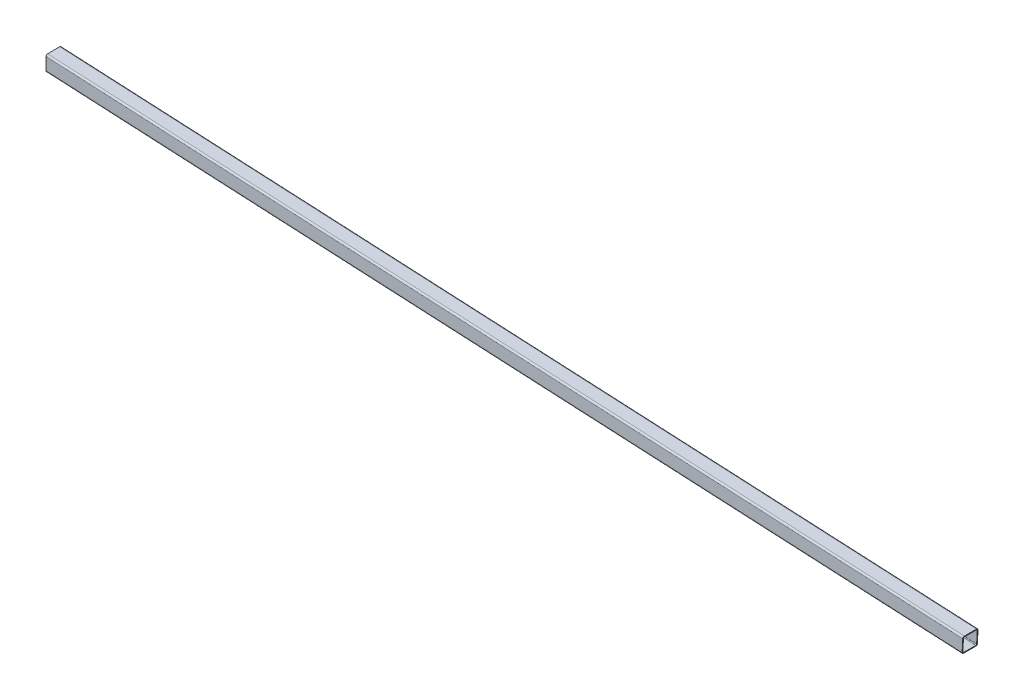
ISO-10303-21;
HEADER;
FILE_DESCRIPTION(('STEP AP214'),'2;1');
FILE_NAME('part.step','',(''),(''),'','','');
FILE_SCHEMA(('AUTOMOTIVE_DESIGN { 1 0 10303 214 1 1 1 1 }'));
ENDSEC;
DATA;
#1=APPLICATION_CONTEXT('core data for automotive mechanical design processes');
#2=APPLICATION_PROTOCOL_DEFINITION('international standard','automotive_design',2000,#1);
#3=PRODUCT_CONTEXT('',#1,'mechanical');
#4=PRODUCT('Part','Part','',(#3));
#5=PRODUCT_RELATED_PRODUCT_CATEGORY('part','',(#4));
#6=PRODUCT_DEFINITION_FORMATION('','',#4);
#7=PRODUCT_DEFINITION_CONTEXT('part definition',#1,'design');
#8=PRODUCT_DEFINITION('design','',#6,#7);
#9=PRODUCT_DEFINITION_SHAPE('','',#8);
#10=(LENGTH_UNIT() NAMED_UNIT(*) SI_UNIT(.MILLI.,.METRE.));
#11=(NAMED_UNIT(*) PLANE_ANGLE_UNIT() SI_UNIT($,.RADIAN.));
#12=(NAMED_UNIT(*) SI_UNIT($,.STERADIAN.) SOLID_ANGLE_UNIT());
#13=UNCERTAINTY_MEASURE_WITH_UNIT(LENGTH_MEASURE(1.E-05),#10,'distance_accuracy_value','');
#14=(GEOMETRIC_REPRESENTATION_CONTEXT(3) GLOBAL_UNCERTAINTY_ASSIGNED_CONTEXT((#13)) GLOBAL_UNIT_ASSIGNED_CONTEXT((#10,
#11,#12)) REPRESENTATION_CONTEXT('',''));
#15=CARTESIAN_POINT('',(0.,0.,0.));
#16=DIRECTION('',(0.,0.,1.));
#17=DIRECTION('',(1.,0.,0.));
#18=AXIS2_PLACEMENT_3D('',#15,#16,#17);
#19=CARTESIAN_POINT('',(6158.33279235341,62.0562979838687,-40.));
#20=DIRECTION('',(0.0500056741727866,0.998748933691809,0.));
#21=DIRECTION('',(-0.998748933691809,0.0500056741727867,0.));
#22=AXIS2_PLACEMENT_3D('',#19,#20,#21);
#23=PLANE('',#22);
#24=DIRECTION('',(-0.998748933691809,0.0500056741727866,0.));
#25=VECTOR('',#24,1.);
#26=CARTESIAN_POINT('',(6158.33279235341,62.0562979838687,40.));
#27=LINE('',#26,#25);
#28=CARTESIAN_POINT('',(6158.33279235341,62.0562979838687,40.));
#29=VERTEX_POINT('',#28);
#30=CARTESIAN_POINT('',(169.999999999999,361.882018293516,40.));
#31=VERTEX_POINT('',#30);
#32=EDGE_CURVE('E150',#29,#31,#27,.T.);
#33=ORIENTED_EDGE('',*,*,#32,.F.);
#34=DIRECTION('',(0.,0.,-1.));
#35=VECTOR('',#34,1.);
#36=CARTESIAN_POINT('',(6158.33279235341,62.0562979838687,-40.));
#37=LINE('',#36,#35);
#38=CARTESIAN_POINT('',(6158.33279235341,62.0562979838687,-40.));
#39=VERTEX_POINT('',#38);
#40=EDGE_CURVE('E53',#29,#39,#37,.T.);
#41=ORIENTED_EDGE('',*,*,#40,.T.);
#42=DIRECTION('',(-0.998748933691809,0.0500056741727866,0.));
#43=VECTOR('',#42,1.);
#44=CARTESIAN_POINT('',(6158.33279235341,62.0562979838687,-40.));
#45=LINE('',#44,#43);
#46=CARTESIAN_POINT('',(169.999999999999,361.882018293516,-40.));
#47=VERTEX_POINT('',#46);
#48=EDGE_CURVE('E38',#39,#47,#45,.T.);
#49=ORIENTED_EDGE('',*,*,#48,.T.);
#50=DIRECTION('',(0.,0.,1.));
#51=VECTOR('',#50,1.);
#52=CARTESIAN_POINT('',(169.999999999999,361.882018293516,-39.9999999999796));
#53=LINE('',#52,#51);
#54=EDGE_CURVE('E193',#47,#31,#53,.T.);
#55=ORIENTED_EDGE('',*,*,#54,.T.);
#56=EDGE_LOOP('',(#33,#41,#49,#55));
#57=FACE_BOUND('',#56,.T.);
#58=ADVANCED_FACE('F34',(#57),#23,.T.);
#59=CARTESIAN_POINT('',(6158.58282072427,67.0500426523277,-40.));
#60=DIRECTION('',(-0.998748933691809,0.0500056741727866,0.));
#61=DIRECTION('',(-0.0500056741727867,-0.998748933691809,0.));
#62=AXIS2_PLACEMENT_3D('',#59,#60,#61);
#63=CYLINDRICAL_SURFACE('',#62,4.99999999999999);
#64=ORIENTED_EDGE('',*,*,#48,.F.);
#65=CARTESIAN_POINT('',(6158.58282072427,67.0500426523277,-40.));
#66=DIRECTION('',(0.998748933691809,-0.0500056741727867,0.));
#67=DIRECTION('',(0.0500056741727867,0.998748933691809,0.));
#68=AXIS2_PLACEMENT_3D('',#65,#66,#67);
#69=CIRCLE('',#68,4.99999999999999);
#70=CARTESIAN_POINT('',(6158.58282072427,67.0500426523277,-45.));
#71=VERTEX_POINT('',#70);
#72=EDGE_CURVE('E186',#39,#71,#69,.T.);
#73=ORIENTED_EDGE('',*,*,#72,.T.);
#74=DIRECTION('',(-0.998748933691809,0.0500056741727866,0.));
#75=VECTOR('',#74,1.);
#76=CARTESIAN_POINT('',(6158.58282072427,67.0500426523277,-45.));
#77=LINE('',#76,#75);
#78=CARTESIAN_POINT('',(169.999999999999,366.888281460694,-45.));
#79=VERTEX_POINT('',#78);
#80=EDGE_CURVE('E184',#71,#79,#77,.T.);
#81=ORIENTED_EDGE('',*,*,#80,.T.);
#82=CARTESIAN_POINT('',(169.999999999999,366.888281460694,-40.));
#83=DIRECTION('',(-1.,0.,0.));
#84=DIRECTION('',(0.,1.,0.));
#85=AXIS2_PLACEMENT_3D('',#82,#83,#84);
#86=ELLIPSE('',#85,5.00626316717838,4.99999999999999);
#87=EDGE_CURVE('E185',#79,#47,#86,.T.);
#88=ORIENTED_EDGE('',*,*,#87,.T.);
#89=EDGE_LOOP('',(#64,#73,#81,#88));
#90=FACE_BOUND('',#89,.T.);
#91=ADVANCED_FACE('F290',(#90),#63,.F.);
#92=CARTESIAN_POINT('',(6158.58282072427,67.0500426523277,-45.));
#93=DIRECTION('',(0.,0.,1.));
#94=DIRECTION('',(0.,-1.,0.));
#95=AXIS2_PLACEMENT_3D('',#92,#93,#94);
#96=PLANE('',#95);
#97=ORIENTED_EDGE('',*,*,#80,.F.);
#98=DIRECTION('',(0.0500056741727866,0.998748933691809,0.));
#99=VECTOR('',#98,1.);
#100=CARTESIAN_POINT('',(6158.58282072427,67.0500426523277,-45.));
#101=LINE('',#100,#99);
#102=CARTESIAN_POINT('',(6162.5832746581,146.949957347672,-45.));
#103=VERTEX_POINT('',#102);
#104=EDGE_CURVE('E183',#71,#103,#101,.T.);
#105=ORIENTED_EDGE('',*,*,#104,.T.);
#106=DIRECTION('',(-0.998748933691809,0.0500056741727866,0.));
#107=VECTOR('',#106,1.);
#108=CARTESIAN_POINT('',(6162.5832746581,146.949957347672,-45.));
#109=LINE('',#108,#107);
#110=CARTESIAN_POINT('',(169.999999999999,446.988492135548,-45.));
#111=VERTEX_POINT('',#110);
#112=EDGE_CURVE('E181',#103,#111,#109,.T.);
#113=ORIENTED_EDGE('',*,*,#112,.T.);
#114=DIRECTION('',(0.,-1.,0.));
#115=VECTOR('',#114,1.);
#116=CARTESIAN_POINT('',(169.999999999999,67.0500426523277,-45.));
#117=LINE('',#116,#115);
#118=EDGE_CURVE('E182',#111,#79,#117,.T.);
#119=ORIENTED_EDGE('',*,*,#118,.T.);
#120=EDGE_LOOP('',(#97,#105,#113,#119));
#121=FACE_BOUND('',#120,.T.);
#122=ADVANCED_FACE('F289',(#121),#96,.T.);
#123=CARTESIAN_POINT('',(6162.5832746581,146.949957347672,-40.));
#124=DIRECTION('',(-0.998748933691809,0.0500056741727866,0.));
#125=DIRECTION('',(-0.0500056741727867,-0.998748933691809,0.));
#126=AXIS2_PLACEMENT_3D('',#123,#124,#125);
#127=CYLINDRICAL_SURFACE('',#126,4.99999999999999);
#128=ORIENTED_EDGE('',*,*,#112,.F.);
#129=CARTESIAN_POINT('',(6162.5832746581,146.949957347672,-40.));
#130=DIRECTION('',(0.998748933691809,-0.0500056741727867,0.));
#131=DIRECTION('',(0.0500056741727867,0.998748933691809,0.));
#132=AXIS2_PLACEMENT_3D('',#129,#130,#131);
#133=CIRCLE('',#132,4.99999999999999);
#134=CARTESIAN_POINT('',(6162.83330302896,151.943702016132,-40.));
#135=VERTEX_POINT('',#134);
#136=EDGE_CURVE('E180',#103,#135,#133,.T.);
#137=ORIENTED_EDGE('',*,*,#136,.T.);
#138=DIRECTION('',(-0.998748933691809,0.0500056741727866,0.));
#139=VECTOR('',#138,1.);
#140=CARTESIAN_POINT('',(6162.83330302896,151.943702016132,-40.));
#141=LINE('',#140,#139);
#142=CARTESIAN_POINT('',(169.999999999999,451.994755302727,-40.));
#143=VERTEX_POINT('',#142);
#144=EDGE_CURVE('E177',#135,#143,#141,.T.);
#145=ORIENTED_EDGE('',*,*,#144,.T.);
#146=CARTESIAN_POINT('',(169.999999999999,446.988492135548,-40.));
#147=DIRECTION('',(-1.,0.,0.));
#148=DIRECTION('',(0.,1.,0.));
#149=AXIS2_PLACEMENT_3D('',#146,#147,#148);
#150=ELLIPSE('',#149,5.00626316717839,4.99999999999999);
#151=EDGE_CURVE('E179',#143,#111,#150,.T.);
#152=ORIENTED_EDGE('',*,*,#151,.T.);
#153=EDGE_LOOP('',(#128,#137,#145,#152));
#154=FACE_BOUND('',#153,.T.);
#155=ADVANCED_FACE('F287',(#154),#127,.F.);
#156=CARTESIAN_POINT('',(6162.83330302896,151.943702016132,40.));
#157=DIRECTION('',(-0.0500056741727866,-0.998748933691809,0.));
#158=DIRECTION('',(0.998748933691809,-0.0500056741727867,0.));
#159=AXIS2_PLACEMENT_3D('',#156,#157,#158);
#160=PLANE('',#159);
#161=ORIENTED_EDGE('',*,*,#144,.F.);
#162=DIRECTION('',(0.,0.,1.));
#163=VECTOR('',#162,1.);
#164=CARTESIAN_POINT('',(6162.83330302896,151.943702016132,40.));
#165=LINE('',#164,#163);
#166=CARTESIAN_POINT('',(6162.83330302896,151.943702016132,40.));
#167=VERTEX_POINT('',#166);
#168=EDGE_CURVE('E176',#135,#167,#165,.T.);
#169=ORIENTED_EDGE('',*,*,#168,.T.);
#170=DIRECTION('',(-0.998748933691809,0.0500056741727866,0.));
#171=VECTOR('',#170,1.);
#172=CARTESIAN_POINT('',(6162.83330302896,151.943702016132,40.));
#173=LINE('',#172,#171);
#174=CARTESIAN_POINT('',(170.,451.994755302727,40.));
#175=VERTEX_POINT('',#174);
#176=EDGE_CURVE('E173',#167,#175,#173,.T.);
#177=ORIENTED_EDGE('',*,*,#176,.T.);
#178=DIRECTION('',(0.,0.,-1.));
#179=VECTOR('',#178,1.);
#180=CARTESIAN_POINT('',(170.,451.994755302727,40.0000000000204));
#181=LINE('',#180,#179);
#182=EDGE_CURVE('E175',#175,#143,#181,.T.);
#183=ORIENTED_EDGE('',*,*,#182,.T.);
#184=EDGE_LOOP('',(#161,#169,#177,#183));
#185=FACE_BOUND('',#184,.T.);
#186=ADVANCED_FACE('F284',(#185),#160,.T.);
#187=CARTESIAN_POINT('',(6162.5832746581,146.949957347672,40.));
#188=DIRECTION('',(-0.998748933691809,0.0500056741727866,0.));
#189=DIRECTION('',(-0.0500056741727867,-0.998748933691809,0.));
#190=AXIS2_PLACEMENT_3D('',#187,#188,#189);
#191=CYLINDRICAL_SURFACE('',#190,4.99999999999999);
#192=ORIENTED_EDGE('',*,*,#176,.F.);
#193=CARTESIAN_POINT('',(6162.5832746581,146.949957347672,40.));
#194=DIRECTION('',(0.998748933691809,-0.0500056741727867,0.));
#195=DIRECTION('',(0.0500056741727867,0.998748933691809,0.));
#196=AXIS2_PLACEMENT_3D('',#193,#194,#195);
#197=CIRCLE('',#196,4.99999999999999);
#198=CARTESIAN_POINT('',(6162.5832746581,146.949957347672,45.));
#199=VERTEX_POINT('',#198);
#200=EDGE_CURVE('E172',#167,#199,#197,.T.);
#201=ORIENTED_EDGE('',*,*,#200,.T.);
#202=DIRECTION('',(-0.998748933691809,0.0500056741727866,0.));
#203=VECTOR('',#202,1.);
#204=CARTESIAN_POINT('',(6162.5832746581,146.949957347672,45.));
#205=LINE('',#204,#203);
#206=CARTESIAN_POINT('',(170.,446.988492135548,45.));
#207=VERTEX_POINT('',#206);
#208=EDGE_CURVE('E158',#199,#207,#205,.T.);
#209=ORIENTED_EDGE('',*,*,#208,.T.);
#210=CARTESIAN_POINT('',(170.,446.988492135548,40.));
#211=DIRECTION('',(-1.,0.,0.));
#212=DIRECTION('',(0.,1.,0.));
#213=AXIS2_PLACEMENT_3D('',#210,#211,#212);
#214=ELLIPSE('',#213,5.00626316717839,4.99999999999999);
#215=EDGE_CURVE('E160',#207,#175,#214,.T.);
#216=ORIENTED_EDGE('',*,*,#215,.T.);
#217=EDGE_LOOP('',(#192,#201,#209,#216));
#218=FACE_BOUND('',#217,.T.);
#219=ADVANCED_FACE('F275',(#218),#191,.F.);
#220=CARTESIAN_POINT('',(6162.5832746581,146.949957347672,45.));
#221=DIRECTION('',(0.,0.,-1.));
#222=DIRECTION('',(0.,1.,0.));
#223=AXIS2_PLACEMENT_3D('',#220,#221,#222);
#224=PLANE('',#223);
#225=ORIENTED_EDGE('',*,*,#208,.F.);
#226=DIRECTION('',(-0.0500056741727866,-0.998748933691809,0.));
#227=VECTOR('',#226,1.);
#228=CARTESIAN_POINT('',(6162.5832746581,146.949957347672,45.));
#229=LINE('',#228,#227);
#230=CARTESIAN_POINT('',(6158.58282072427,67.0500426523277,45.));
#231=VERTEX_POINT('',#230);
#232=EDGE_CURVE('E143',#199,#231,#229,.T.);
#233=ORIENTED_EDGE('',*,*,#232,.T.);
#234=DIRECTION('',(-0.998748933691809,0.0500056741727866,0.));
#235=VECTOR('',#234,1.);
#236=CARTESIAN_POINT('',(6158.58282072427,67.0500426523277,45.));
#237=LINE('',#236,#235);
#238=CARTESIAN_POINT('',(170.,366.888281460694,45.));
#239=VERTEX_POINT('',#238);
#240=EDGE_CURVE('E156',#231,#239,#237,.T.);
#241=ORIENTED_EDGE('',*,*,#240,.T.);
#242=DIRECTION('',(0.,1.,0.));
#243=VECTOR('',#242,1.);
#244=CARTESIAN_POINT('',(170.,146.949957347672,45.));
#245=LINE('',#244,#243);
#246=EDGE_CURVE('E151',#239,#207,#245,.T.);
#247=ORIENTED_EDGE('',*,*,#246,.T.);
#248=EDGE_LOOP('',(#225,#233,#241,#247));
#249=FACE_BOUND('',#248,.T.);
#250=ADVANCED_FACE('F154',(#249),#224,.T.);
#251=CARTESIAN_POINT('',(6158.58282072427,67.0500426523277,40.));
#252=DIRECTION('',(-0.998748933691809,0.0500056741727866,0.));
#253=DIRECTION('',(-0.0500056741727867,-0.998748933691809,0.));
#254=AXIS2_PLACEMENT_3D('',#251,#252,#253);
#255=CYLINDRICAL_SURFACE('',#254,4.99999999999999);
#256=ORIENTED_EDGE('',*,*,#240,.F.);
#257=CARTESIAN_POINT('',(6158.58282072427,67.0500426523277,40.));
#258=DIRECTION('',(0.998748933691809,-0.0500056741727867,0.));
#259=DIRECTION('',(0.0500056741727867,0.998748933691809,0.));
#260=AXIS2_PLACEMENT_3D('',#257,#258,#259);
#261=CIRCLE('',#260,4.99999999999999);
#262=EDGE_CURVE('E146',#231,#29,#261,.T.);
#263=ORIENTED_EDGE('',*,*,#262,.T.);
#264=ORIENTED_EDGE('',*,*,#32,.T.);
#265=CARTESIAN_POINT('',(170.,366.888281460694,40.));
#266=DIRECTION('',(-1.,0.,0.));
#267=DIRECTION('',(0.,1.,0.));
#268=AXIS2_PLACEMENT_3D('',#265,#266,#267);
#269=ELLIPSE('',#268,5.00626316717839,4.99999999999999);
#270=EDGE_CURVE('E165',#31,#239,#269,.T.);
#271=ORIENTED_EDGE('',*,*,#270,.T.);
#272=EDGE_LOOP('',(#256,#263,#264,#271));
#273=FACE_BOUND('',#272,.T.);
#274=ADVANCED_FACE('F163',(#273),#255,.F.);
#275=CARTESIAN_POINT('',(6163.08333139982,156.937446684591,40.));
#276=DIRECTION('',(-0.0500056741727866,-0.998748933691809,0.));
#277=DIRECTION('',(0.998748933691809,-0.0500056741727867,0.));
#278=AXIS2_PLACEMENT_3D('',#275,#276,#277);
#279=PLANE('',#278);
#280=DIRECTION('',(0.,0.,1.));
#281=VECTOR('',#280,1.);
#282=CARTESIAN_POINT('',(6163.08333139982,156.937446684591,40.));
#283=LINE('',#282,#281);
#284=CARTESIAN_POINT('',(6163.08333139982,156.93744668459,-40.));
#285=VERTEX_POINT('',#284);
#286=CARTESIAN_POINT('',(6163.08333139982,156.93744668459,40.));
#287=VERTEX_POINT('',#286);
#288=EDGE_CURVE('E11',#285,#287,#283,.T.);
#289=ORIENTED_EDGE('',*,*,#288,.F.);
#290=DIRECTION('',(-0.998748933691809,0.0500056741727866,0.));
#291=VECTOR('',#290,1.);
#292=CARTESIAN_POINT('',(6163.08333139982,156.937446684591,-40.));
#293=LINE('',#292,#291);
#294=CARTESIAN_POINT('',(170.,457.001018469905,-40.));
#295=VERTEX_POINT('',#294);
#296=EDGE_CURVE('E222',#285,#295,#293,.T.);
#297=ORIENTED_EDGE('',*,*,#296,.T.);
#298=DIRECTION('',(0.,0.,-1.));
#299=VECTOR('',#298,1.);
#300=CARTESIAN_POINT('',(170.,457.001018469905,40.0000000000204));
#301=LINE('',#300,#299);
#302=CARTESIAN_POINT('',(170.,457.001018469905,40.));
#303=VERTEX_POINT('',#302);
#304=EDGE_CURVE('E230',#303,#295,#301,.T.);
#305=ORIENTED_EDGE('',*,*,#304,.F.);
#306=DIRECTION('',(-0.998748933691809,0.0500056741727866,0.));
#307=VECTOR('',#306,1.);
#308=CARTESIAN_POINT('',(6163.08333139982,156.937446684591,40.));
#309=LINE('',#308,#307);
#310=EDGE_CURVE('E208',#287,#303,#309,.T.);
#311=ORIENTED_EDGE('',*,*,#310,.F.);
#312=EDGE_LOOP('',(#289,#297,#305,#311));
#313=FACE_BOUND('',#312,.T.);
#314=ADVANCED_FACE('F326',(#313),#279,.F.);
#315=CARTESIAN_POINT('',(6162.5832746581,146.949957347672,-40.));
#316=DIRECTION('',(-0.998748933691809,0.0500056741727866,0.));
#317=DIRECTION('',(-0.0500056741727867,-0.998748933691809,0.));
#318=AXIS2_PLACEMENT_3D('',#315,#316,#317);
#319=CYLINDRICAL_SURFACE('',#318,10.);
#320=CARTESIAN_POINT('',(6162.5832746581,146.949957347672,-40.));
#321=DIRECTION('',(0.998748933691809,-0.0500056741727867,0.));
#322=DIRECTION('',(0.0500056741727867,0.998748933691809,0.));
#323=AXIS2_PLACEMENT_3D('',#320,#321,#322);
#324=CIRCLE('',#323,10.);
#325=CARTESIAN_POINT('',(6162.5832746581,146.949957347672,-50.));
#326=VERTEX_POINT('',#325);
#327=EDGE_CURVE('E44',#326,#285,#324,.T.);
#328=ORIENTED_EDGE('',*,*,#327,.F.);
#329=DIRECTION('',(-0.998748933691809,0.0500056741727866,0.));
#330=VECTOR('',#329,1.);
#331=CARTESIAN_POINT('',(6162.5832746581,146.949957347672,-50.));
#332=LINE('',#331,#330);
#333=CARTESIAN_POINT('',(169.999999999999,446.988492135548,-50.));
#334=VERTEX_POINT('',#333);
#335=EDGE_CURVE('E221',#326,#334,#332,.T.);
#336=ORIENTED_EDGE('',*,*,#335,.T.);
#337=CARTESIAN_POINT('',(169.999999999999,446.988492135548,-40.));
#338=DIRECTION('',(-1.,0.,0.));
#339=DIRECTION('',(0.,1.,0.));
#340=AXIS2_PLACEMENT_3D('',#337,#338,#339);
#341=ELLIPSE('',#340,10.0125263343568,10.);
#342=EDGE_CURVE('E231',#295,#334,#341,.T.);
#343=ORIENTED_EDGE('',*,*,#342,.F.);
#344=ORIENTED_EDGE('',*,*,#296,.F.);
#345=EDGE_LOOP('',(#328,#336,#343,#344));
#346=FACE_BOUND('',#345,.T.);
#347=ADVANCED_FACE('F323',(#346),#319,.T.);
#348=CARTESIAN_POINT('',(6158.58282072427,67.0500426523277,-50.));
#349=DIRECTION('',(0.,0.,1.));
#350=DIRECTION('',(0.,-1.,0.));
#351=AXIS2_PLACEMENT_3D('',#348,#349,#350);
#352=PLANE('',#351);
#353=DIRECTION('',(0.0500056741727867,0.998748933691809,0.));
#354=VECTOR('',#353,1.);
#355=CARTESIAN_POINT('',(6158.58282072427,67.0500426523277,-50.));
#356=LINE('',#355,#354);
#357=CARTESIAN_POINT('',(6158.58282072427,67.0500426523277,-50.));
#358=VERTEX_POINT('',#357);
#359=EDGE_CURVE('E235',#358,#326,#356,.T.);
#360=ORIENTED_EDGE('',*,*,#359,.F.);
#361=DIRECTION('',(-0.998748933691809,0.0500056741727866,0.));
#362=VECTOR('',#361,1.);
#363=CARTESIAN_POINT('',(6158.58282072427,67.0500426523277,-50.));
#364=LINE('',#363,#362);
#365=CARTESIAN_POINT('',(169.999999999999,366.888281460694,-50.));
#366=VERTEX_POINT('',#365);
#367=EDGE_CURVE('E219',#358,#366,#364,.T.);
#368=ORIENTED_EDGE('',*,*,#367,.T.);
#369=DIRECTION('',(0.,-1.,0.));
#370=VECTOR('',#369,1.);
#371=CARTESIAN_POINT('',(169.999999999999,67.0500426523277,-50.));
#372=LINE('',#371,#370);
#373=EDGE_CURVE('E345',#334,#366,#372,.T.);
#374=ORIENTED_EDGE('',*,*,#373,.F.);
#375=ORIENTED_EDGE('',*,*,#335,.F.);
#376=EDGE_LOOP('',(#360,#368,#374,#375));
#377=FACE_BOUND('',#376,.T.);
#378=ADVANCED_FACE('F319',(#377),#352,.F.);
#379=CARTESIAN_POINT('',(6158.58282072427,67.0500426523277,-40.));
#380=DIRECTION('',(-0.998748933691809,0.0500056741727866,0.));
#381=DIRECTION('',(-0.0500056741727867,-0.998748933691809,0.));
#382=AXIS2_PLACEMENT_3D('',#379,#380,#381);
#383=CYLINDRICAL_SURFACE('',#382,9.99999999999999);
#384=CARTESIAN_POINT('',(6158.58282072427,67.0500426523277,-40.));
#385=DIRECTION('',(0.998748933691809,-0.0500056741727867,0.));
#386=DIRECTION('',(0.0500056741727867,0.998748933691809,0.));
#387=AXIS2_PLACEMENT_3D('',#384,#385,#386);
#388=CIRCLE('',#387,9.99999999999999);
#389=CARTESIAN_POINT('',(6158.08276398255,57.0625533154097,-40.));
#390=VERTEX_POINT('',#389);
#391=EDGE_CURVE('E238',#390,#358,#388,.T.);
#392=ORIENTED_EDGE('',*,*,#391,.F.);
#393=DIRECTION('',(-0.998748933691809,0.0500056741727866,0.));
#394=VECTOR('',#393,1.);
#395=CARTESIAN_POINT('',(6158.08276398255,57.0625533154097,-40.));
#396=LINE('',#395,#394);
#397=CARTESIAN_POINT('',(169.999999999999,356.875755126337,-40.));
#398=VERTEX_POINT('',#397);
#399=EDGE_CURVE('E217',#390,#398,#396,.T.);
#400=ORIENTED_EDGE('',*,*,#399,.T.);
#401=CARTESIAN_POINT('',(169.999999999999,366.888281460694,-40.));
#402=DIRECTION('',(-1.,0.,0.));
#403=DIRECTION('',(0.,1.,0.));
#404=AXIS2_PLACEMENT_3D('',#401,#402,#403);
#405=ELLIPSE('',#404,10.0125263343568,9.99999999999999);
#406=EDGE_CURVE('E342',#366,#398,#405,.T.);
#407=ORIENTED_EDGE('',*,*,#406,.F.);
#408=ORIENTED_EDGE('',*,*,#367,.F.);
#409=EDGE_LOOP('',(#392,#400,#407,#408));
#410=FACE_BOUND('',#409,.T.);
#411=ADVANCED_FACE('F315',(#410),#383,.T.);
#412=CARTESIAN_POINT('',(6158.08276398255,57.0625533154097,-40.));
#413=DIRECTION('',(0.0500056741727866,0.998748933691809,0.));
#414=DIRECTION('',(-0.998748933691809,0.0500056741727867,0.));
#415=AXIS2_PLACEMENT_3D('',#412,#413,#414);
#416=PLANE('',#415);
#417=DIRECTION('',(0.,0.,-1.));
#418=VECTOR('',#417,1.);
#419=CARTESIAN_POINT('',(6158.08276398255,57.0625533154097,-40.));
#420=LINE('',#419,#418);
#421=CARTESIAN_POINT('',(6158.08276398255,57.0625533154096,40.));
#422=VERTEX_POINT('',#421);
#423=EDGE_CURVE('E241',#422,#390,#420,.T.);
#424=ORIENTED_EDGE('',*,*,#423,.F.);
#425=DIRECTION('',(-0.998748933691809,0.0500056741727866,0.));
#426=VECTOR('',#425,1.);
#427=CARTESIAN_POINT('',(6158.08276398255,57.0625533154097,40.));
#428=LINE('',#427,#426);
#429=CARTESIAN_POINT('',(169.999999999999,356.875755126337,40.));
#430=VERTEX_POINT('',#429);
#431=EDGE_CURVE('E215',#422,#430,#428,.T.);
#432=ORIENTED_EDGE('',*,*,#431,.T.);
#433=DIRECTION('',(0.,0.,1.));
#434=VECTOR('',#433,1.);
#435=CARTESIAN_POINT('',(169.999999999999,356.875755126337,-39.9999999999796));
#436=LINE('',#435,#434);
#437=EDGE_CURVE('E261',#398,#430,#436,.T.);
#438=ORIENTED_EDGE('',*,*,#437,.F.);
#439=ORIENTED_EDGE('',*,*,#399,.F.);
#440=EDGE_LOOP('',(#424,#432,#438,#439));
#441=FACE_BOUND('',#440,.T.);
#442=ADVANCED_FACE('F311',(#441),#416,.F.);
#443=CARTESIAN_POINT('',(6158.58282072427,67.0500426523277,40.));
#444=DIRECTION('',(-0.998748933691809,0.0500056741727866,0.));
#445=DIRECTION('',(-0.0500056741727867,-0.998748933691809,0.));
#446=AXIS2_PLACEMENT_3D('',#443,#444,#445);
#447=CYLINDRICAL_SURFACE('',#446,10.);
#448=CARTESIAN_POINT('',(6158.58282072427,67.0500426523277,40.));
#449=DIRECTION('',(0.998748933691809,-0.0500056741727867,0.));
#450=DIRECTION('',(0.0500056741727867,0.998748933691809,0.));
#451=AXIS2_PLACEMENT_3D('',#448,#449,#450);
#452=CIRCLE('',#451,10.);
#453=CARTESIAN_POINT('',(6158.58282072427,67.0500426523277,50.));
#454=VERTEX_POINT('',#453);
#455=EDGE_CURVE('E244',#454,#422,#452,.T.);
#456=ORIENTED_EDGE('',*,*,#455,.F.);
#457=DIRECTION('',(-0.998748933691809,0.0500056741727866,0.));
#458=VECTOR('',#457,1.);
#459=CARTESIAN_POINT('',(6158.58282072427,67.0500426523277,50.));
#460=LINE('',#459,#458);
#461=CARTESIAN_POINT('',(170.,366.888281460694,50.));
#462=VERTEX_POINT('',#461);
#463=EDGE_CURVE('E213',#454,#462,#460,.T.);
#464=ORIENTED_EDGE('',*,*,#463,.T.);
#465=CARTESIAN_POINT('',(170.,366.888281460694,40.));
#466=DIRECTION('',(-1.,0.,0.));
#467=DIRECTION('',(0.,1.,0.));
#468=AXIS2_PLACEMENT_3D('',#465,#466,#467);
#469=ELLIPSE('',#468,10.0125263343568,10.);
#470=EDGE_CURVE('E254',#430,#462,#469,.T.);
#471=ORIENTED_EDGE('',*,*,#470,.F.);
#472=ORIENTED_EDGE('',*,*,#431,.F.);
#473=EDGE_LOOP('',(#456,#464,#471,#472));
#474=FACE_BOUND('',#473,.T.);
#475=ADVANCED_FACE('F307',(#474),#447,.T.);
#476=CARTESIAN_POINT('',(6162.5832746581,146.949957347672,50.));
#477=DIRECTION('',(0.,0.,-1.));
#478=DIRECTION('',(0.,1.,0.));
#479=AXIS2_PLACEMENT_3D('',#476,#477,#478);
#480=PLANE('',#479);
#481=DIRECTION('',(-0.0500056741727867,-0.998748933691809,0.));
#482=VECTOR('',#481,1.);
#483=CARTESIAN_POINT('',(6162.5832746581,146.949957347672,50.));
#484=LINE('',#483,#482);
#485=CARTESIAN_POINT('',(6162.5832746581,146.949957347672,50.));
#486=VERTEX_POINT('',#485);
#487=EDGE_CURVE('E247',#486,#454,#484,.T.);
#488=ORIENTED_EDGE('',*,*,#487,.F.);
#489=DIRECTION('',(-0.998748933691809,0.0500056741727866,0.));
#490=VECTOR('',#489,1.);
#491=CARTESIAN_POINT('',(6162.5832746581,146.949957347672,50.));
#492=LINE('',#491,#490);
#493=CARTESIAN_POINT('',(170.,446.988492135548,50.));
#494=VERTEX_POINT('',#493);
#495=EDGE_CURVE('E211',#486,#494,#492,.T.);
#496=ORIENTED_EDGE('',*,*,#495,.T.);
#497=DIRECTION('',(0.,1.,0.));
#498=VECTOR('',#497,1.);
#499=CARTESIAN_POINT('',(170.,146.949957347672,50.));
#500=LINE('',#499,#498);
#501=EDGE_CURVE('E251',#462,#494,#500,.T.);
#502=ORIENTED_EDGE('',*,*,#501,.F.);
#503=ORIENTED_EDGE('',*,*,#463,.F.);
#504=EDGE_LOOP('',(#488,#496,#502,#503));
#505=FACE_BOUND('',#504,.T.);
#506=ADVANCED_FACE('F303',(#505),#480,.F.);
#507=CARTESIAN_POINT('',(6162.5832746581,146.949957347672,40.));
#508=DIRECTION('',(-0.998748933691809,0.0500056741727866,0.));
#509=DIRECTION('',(-0.0500056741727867,-0.998748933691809,0.));
#510=AXIS2_PLACEMENT_3D('',#507,#508,#509);
#511=CYLINDRICAL_SURFACE('',#510,10.);
#512=CARTESIAN_POINT('',(6162.5832746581,146.949957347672,40.));
#513=DIRECTION('',(0.998748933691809,-0.0500056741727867,0.));
#514=DIRECTION('',(0.0500056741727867,0.998748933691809,0.));
#515=AXIS2_PLACEMENT_3D('',#512,#513,#514);
#516=CIRCLE('',#515,10.);
#517=EDGE_CURVE('E249',#287,#486,#516,.T.);
#518=ORIENTED_EDGE('',*,*,#517,.F.);
#519=ORIENTED_EDGE('',*,*,#310,.T.);
#520=CARTESIAN_POINT('',(170.,446.988492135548,40.));
#521=DIRECTION('',(-1.,0.,0.));
#522=DIRECTION('',(0.,1.,0.));
#523=AXIS2_PLACEMENT_3D('',#520,#521,#522);
#524=ELLIPSE('',#523,10.0125263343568,10.);
#525=EDGE_CURVE('E210',#494,#303,#524,.T.);
#526=ORIENTED_EDGE('',*,*,#525,.F.);
#527=ORIENTED_EDGE('',*,*,#495,.F.);
#528=EDGE_LOOP('',(#518,#519,#526,#527));
#529=FACE_BOUND('',#528,.T.);
#530=ADVANCED_FACE('F300',(#529),#511,.T.);
#531=CARTESIAN_POINT('',(169.999999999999,1900.,-147.000000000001));
#532=DIRECTION('',(-1.,0.,0.));
#533=DIRECTION('',(0.,0.,1.));
#534=AXIS2_PLACEMENT_3D('',#531,#532,#533);
#535=PLANE('',#534);
#536=ORIENTED_EDGE('',*,*,#54,.F.);
#537=ORIENTED_EDGE('',*,*,#87,.F.);
#538=ORIENTED_EDGE('',*,*,#118,.F.);
#539=ORIENTED_EDGE('',*,*,#151,.F.);
#540=ORIENTED_EDGE('',*,*,#182,.F.);
#541=ORIENTED_EDGE('',*,*,#215,.F.);
#542=ORIENTED_EDGE('',*,*,#246,.F.);
#543=ORIENTED_EDGE('',*,*,#270,.F.);
#544=EDGE_LOOP('',(#536,#537,#538,#539,#540,#541,#542,#543));
#545=FACE_BOUND('',#544,.T.);
#546=ORIENTED_EDGE('',*,*,#525,.T.);
#547=ORIENTED_EDGE('',*,*,#304,.T.);
#548=ORIENTED_EDGE('',*,*,#342,.T.);
#549=ORIENTED_EDGE('',*,*,#373,.T.);
#550=ORIENTED_EDGE('',*,*,#406,.T.);
#551=ORIENTED_EDGE('',*,*,#437,.T.);
#552=ORIENTED_EDGE('',*,*,#470,.T.);
#553=ORIENTED_EDGE('',*,*,#501,.T.);
#554=EDGE_LOOP('',(#546,#547,#548,#549,#550,#551,#552,#553));
#555=FACE_BOUND('',#554,.T.);
#556=ADVANCED_FACE('F279',(#545,#555),#535,.T.);
#557=CARTESIAN_POINT('',(6162.5832746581,146.949957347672,40.));
#558=DIRECTION('',(0.998748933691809,-0.0500056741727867,0.));
#559=DIRECTION('',(0.0500056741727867,0.998748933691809,0.));
#560=AXIS2_PLACEMENT_3D('',#557,#558,#559);
#561=PLANE('',#560);
#562=ORIENTED_EDGE('',*,*,#262,.F.);
#563=ORIENTED_EDGE('',*,*,#232,.F.);
#564=ORIENTED_EDGE('',*,*,#200,.F.);
#565=ORIENTED_EDGE('',*,*,#168,.F.);
#566=ORIENTED_EDGE('',*,*,#136,.F.);
#567=ORIENTED_EDGE('',*,*,#104,.F.);
#568=ORIENTED_EDGE('',*,*,#72,.F.);
#569=ORIENTED_EDGE('',*,*,#40,.F.);
#570=EDGE_LOOP('',(#562,#563,#564,#565,#566,#567,#568,#569));
#571=FACE_BOUND('',#570,.T.);
#572=ORIENTED_EDGE('',*,*,#517,.T.);
#573=ORIENTED_EDGE('',*,*,#487,.T.);
#574=ORIENTED_EDGE('',*,*,#455,.T.);
#575=ORIENTED_EDGE('',*,*,#423,.T.);
#576=ORIENTED_EDGE('',*,*,#391,.T.);
#577=ORIENTED_EDGE('',*,*,#359,.T.);
#578=ORIENTED_EDGE('',*,*,#327,.T.);
#579=ORIENTED_EDGE('',*,*,#288,.T.);
#580=EDGE_LOOP('',(#572,#573,#574,#575,#576,#577,#578,#579));
#581=FACE_BOUND('',#580,.T.);
#582=ADVANCED_FACE('F36',(#571,#581),#561,.T.);
#583=CLOSED_SHELL('',(#58,#91,#122,#155,#186,#219,#250,#274,#314,#347,#378,#411,#442,#475,#506,
#530,#556,#582));
#584=MANIFOLD_SOLID_BREP('B2',#583);
#585=ADVANCED_BREP_SHAPE_REPRESENTATION('',(#18,#584),#14);
#586=SHAPE_DEFINITION_REPRESENTATION(#9,#585);
ENDSEC;
END-ISO-10303-21;
